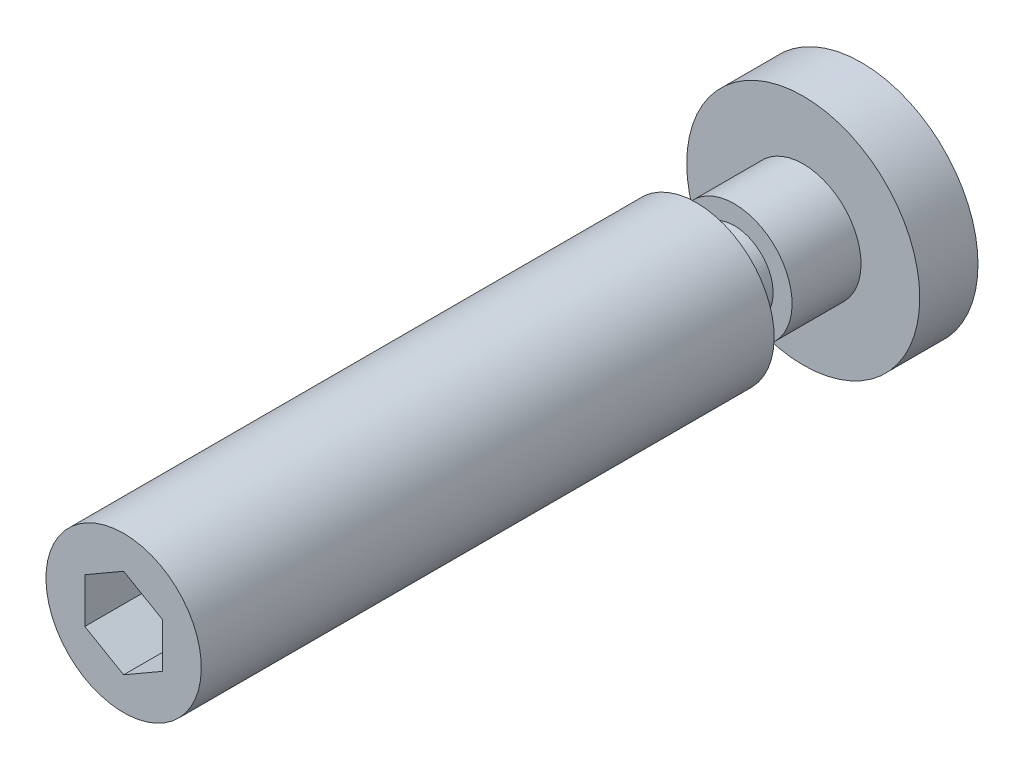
ISO-10303-21;
HEADER;
FILE_DESCRIPTION(('STEP AP214'),'2;1');
FILE_NAME('part.step','',(''),(''),'','','');
FILE_SCHEMA(('AUTOMOTIVE_DESIGN { 1 0 10303 214 1 1 1 1 }'));
ENDSEC;
DATA;
#1=APPLICATION_CONTEXT('core data for automotive mechanical design processes');
#2=APPLICATION_PROTOCOL_DEFINITION('international standard','automotive_design',2000,#1);
#3=PRODUCT_CONTEXT('',#1,'mechanical');
#4=PRODUCT('Part','Part','',(#3));
#5=PRODUCT_RELATED_PRODUCT_CATEGORY('part','',(#4));
#6=PRODUCT_DEFINITION_FORMATION('','',#4);
#7=PRODUCT_DEFINITION_CONTEXT('part definition',#1,'design');
#8=PRODUCT_DEFINITION('design','',#6,#7);
#9=PRODUCT_DEFINITION_SHAPE('','',#8);
#10=(LENGTH_UNIT() NAMED_UNIT(*) SI_UNIT(.MILLI.,.METRE.));
#11=(NAMED_UNIT(*) PLANE_ANGLE_UNIT() SI_UNIT($,.RADIAN.));
#12=(NAMED_UNIT(*) SI_UNIT($,.STERADIAN.) SOLID_ANGLE_UNIT());
#13=UNCERTAINTY_MEASURE_WITH_UNIT(LENGTH_MEASURE(1.E-05),#10,'distance_accuracy_value','');
#14=(GEOMETRIC_REPRESENTATION_CONTEXT(3) GLOBAL_UNCERTAINTY_ASSIGNED_CONTEXT((#13)) GLOBAL_UNIT_ASSIGNED_CONTEXT((#10,
#11,#12)) REPRESENTATION_CONTEXT('',''));
#15=CARTESIAN_POINT('',(0.,0.,0.));
#16=DIRECTION('',(0.,0.,1.));
#17=DIRECTION('',(1.,0.,0.));
#18=AXIS2_PLACEMENT_3D('',#15,#16,#17);
#19=CARTESIAN_POINT('',(0.,0.,0.));
#20=DIRECTION('',(0.,0.,1.));
#21=DIRECTION('',(0.,1.,0.));
#22=AXIS2_PLACEMENT_3D('',#19,#20,#21);
#23=PLANE('',#22);
#24=CARTESIAN_POINT('',(0.,0.,0.));
#25=DIRECTION('',(0.,0.,1.));
#26=DIRECTION('',(0.,1.,0.));
#27=AXIS2_PLACEMENT_3D('',#24,#25,#26);
#28=CIRCLE('',#27,12.);
#29=CARTESIAN_POINT('',(0.,12.,0.));
#30=VERTEX_POINT('',#29);
#31=EDGE_CURVE('E9',#30,#30,#28,.T.);
#32=ORIENTED_EDGE('',*,*,#31,.F.);
#33=EDGE_LOOP('',(#32));
#34=FACE_BOUND('',#33,.T.);
#35=ADVANCED_FACE('F14',(#34),#23,.F.);
#36=CARTESIAN_POINT('',(0.,0.,40.));
#37=DIRECTION('',(0.,0.,1.));
#38=DIRECTION('',(0.,1.,0.));
#39=AXIS2_PLACEMENT_3D('',#36,#37,#38);
#40=CYLINDRICAL_SURFACE('',#39,12.);
#41=CARTESIAN_POINT('',(0.,0.,6.));
#42=DIRECTION('',(0.,0.,1.));
#43=DIRECTION('',(0.,1.,0.));
#44=AXIS2_PLACEMENT_3D('',#41,#42,#43);
#45=CIRCLE('',#44,12.);
#46=CARTESIAN_POINT('',(0.,12.,6.));
#47=VERTEX_POINT('',#46);
#48=EDGE_CURVE('E21',#47,#47,#45,.T.);
#49=ORIENTED_EDGE('',*,*,#48,.F.);
#50=EDGE_LOOP('',(#49));
#51=FACE_BOUND('',#50,.T.);
#52=ORIENTED_EDGE('',*,*,#31,.T.);
#53=EDGE_LOOP('',(#52));
#54=FACE_BOUND('',#53,.T.);
#55=ADVANCED_FACE('F142',(#51,#54),#40,.T.);
#56=CARTESIAN_POINT('',(0.,-12.,6.));
#57=DIRECTION('',(0.,0.,-1.));
#58=DIRECTION('',(0.,-1.,0.));
#59=AXIS2_PLACEMENT_3D('',#56,#57,#58);
#60=PLANE('',#59);
#61=CARTESIAN_POINT('',(0.,0.,6.));
#62=DIRECTION('',(0.,0.,1.));
#63=DIRECTION('',(0.,1.,0.));
#64=AXIS2_PLACEMENT_3D('',#61,#62,#63);
#65=CIRCLE('',#64,5.95);
#66=CARTESIAN_POINT('',(0.,5.95,6.));
#67=VERTEX_POINT('',#66);
#68=EDGE_CURVE('E135',#67,#67,#65,.T.);
#69=ORIENTED_EDGE('',*,*,#68,.F.);
#70=EDGE_LOOP('',(#69));
#71=FACE_BOUND('',#70,.T.);
#72=ORIENTED_EDGE('',*,*,#48,.T.);
#73=EDGE_LOOP('',(#72));
#74=FACE_BOUND('',#73,.T.);
#75=ADVANCED_FACE('F140',(#71,#74),#60,.F.);
#76=CARTESIAN_POINT('',(0.,0.,40.));
#77=DIRECTION('',(0.,0.,1.));
#78=DIRECTION('',(0.,1.,0.));
#79=AXIS2_PLACEMENT_3D('',#76,#77,#78);
#80=CYLINDRICAL_SURFACE('',#79,5.95);
#81=CARTESIAN_POINT('',(0.,0.,13.1));
#82=DIRECTION('',(0.,0.,1.));
#83=DIRECTION('',(0.,1.,0.));
#84=AXIS2_PLACEMENT_3D('',#81,#82,#83);
#85=CIRCLE('',#84,5.95);
#86=CARTESIAN_POINT('',(0.,5.95,13.1));
#87=VERTEX_POINT('',#86);
#88=EDGE_CURVE('E132',#87,#87,#85,.T.);
#89=ORIENTED_EDGE('',*,*,#88,.F.);
#90=EDGE_LOOP('',(#89));
#91=FACE_BOUND('',#90,.T.);
#92=ORIENTED_EDGE('',*,*,#68,.T.);
#93=EDGE_LOOP('',(#92));
#94=FACE_BOUND('',#93,.T.);
#95=ADVANCED_FACE('F165',(#91,#94),#80,.T.);
#96=CARTESIAN_POINT('',(0.,-5.95,13.1));
#97=DIRECTION('',(0.,0.,-1.));
#98=DIRECTION('',(0.,-1.,0.));
#99=AXIS2_PLACEMENT_3D('',#96,#97,#98);
#100=PLANE('',#99);
#101=CARTESIAN_POINT('',(0.,0.,13.1));
#102=DIRECTION('',(0.,0.,1.));
#103=DIRECTION('',(0.,1.,0.));
#104=AXIS2_PLACEMENT_3D('',#101,#102,#103);
#105=CIRCLE('',#104,4.);
#106=CARTESIAN_POINT('',(0.,4.,13.1));
#107=VERTEX_POINT('',#106);
#108=EDGE_CURVE('E129',#107,#107,#105,.T.);
#109=ORIENTED_EDGE('',*,*,#108,.F.);
#110=EDGE_LOOP('',(#109));
#111=FACE_BOUND('',#110,.T.);
#112=ORIENTED_EDGE('',*,*,#88,.T.);
#113=EDGE_LOOP('',(#112));
#114=FACE_BOUND('',#113,.T.);
#115=ADVANCED_FACE('F174',(#111,#114),#100,.F.);
#116=CARTESIAN_POINT('',(0.,0.,40.));
#117=DIRECTION('',(0.,0.,1.));
#118=DIRECTION('',(0.,1.,0.));
#119=AXIS2_PLACEMENT_3D('',#116,#117,#118);
#120=CYLINDRICAL_SURFACE('',#119,4.);
#121=CARTESIAN_POINT('',(0.,0.,17.));
#122=DIRECTION('',(0.,0.,1.));
#123=DIRECTION('',(0.,1.,0.));
#124=AXIS2_PLACEMENT_3D('',#121,#122,#123);
#125=CIRCLE('',#124,4.);
#126=CARTESIAN_POINT('',(0.,4.,17.));
#127=VERTEX_POINT('',#126);
#128=EDGE_CURVE('E126',#127,#127,#125,.T.);
#129=ORIENTED_EDGE('',*,*,#128,.F.);
#130=EDGE_LOOP('',(#129));
#131=FACE_BOUND('',#130,.T.);
#132=ORIENTED_EDGE('',*,*,#108,.T.);
#133=EDGE_LOOP('',(#132));
#134=FACE_BOUND('',#133,.T.);
#135=ADVANCED_FACE('F183',(#131,#134),#120,.T.);
#136=CARTESIAN_POINT('',(0.,-4.,17.));
#137=DIRECTION('',(0.,0.,1.));
#138=DIRECTION('',(0.,1.,0.));
#139=AXIS2_PLACEMENT_3D('',#136,#137,#138);
#140=PLANE('',#139);
#141=CARTESIAN_POINT('',(0.,0.,17.));
#142=DIRECTION('',(0.,0.,1.));
#143=DIRECTION('',(0.,1.,0.));
#144=AXIS2_PLACEMENT_3D('',#141,#142,#143);
#145=CIRCLE('',#144,8.);
#146=CARTESIAN_POINT('',(0.,8.,17.));
#147=VERTEX_POINT('',#146);
#148=EDGE_CURVE('E123',#147,#147,#145,.T.);
#149=ORIENTED_EDGE('',*,*,#148,.F.);
#150=EDGE_LOOP('',(#149));
#151=FACE_BOUND('',#150,.T.);
#152=ORIENTED_EDGE('',*,*,#128,.T.);
#153=EDGE_LOOP('',(#152));
#154=FACE_BOUND('',#153,.T.);
#155=ADVANCED_FACE('F192',(#151,#154),#140,.F.);
#156=CARTESIAN_POINT('',(0.,0.,40.));
#157=DIRECTION('',(0.,0.,1.));
#158=DIRECTION('',(0.,1.,0.));
#159=AXIS2_PLACEMENT_3D('',#156,#157,#158);
#160=CYLINDRICAL_SURFACE('',#159,8.);
#161=CARTESIAN_POINT('',(0.,0.,76.));
#162=DIRECTION('',(0.,0.,1.));
#163=DIRECTION('',(0.,1.,0.));
#164=AXIS2_PLACEMENT_3D('',#161,#162,#163);
#165=CIRCLE('',#164,8.);
#166=CARTESIAN_POINT('',(0.,8.,76.));
#167=VERTEX_POINT('',#166);
#168=EDGE_CURVE('E115',#167,#167,#165,.T.);
#169=ORIENTED_EDGE('',*,*,#168,.F.);
#170=EDGE_LOOP('',(#169));
#171=FACE_BOUND('',#170,.T.);
#172=ORIENTED_EDGE('',*,*,#148,.T.);
#173=EDGE_LOOP('',(#172));
#174=FACE_BOUND('',#173,.T.);
#175=ADVANCED_FACE('F201',(#171,#174),#160,.T.);
#176=CARTESIAN_POINT('',(0.,-8.,76.));
#177=DIRECTION('',(0.,0.,-1.));
#178=DIRECTION('',(0.,-1.,0.));
#179=AXIS2_PLACEMENT_3D('',#176,#177,#178);
#180=PLANE('',#179);
#181=DIRECTION('',(-0.866025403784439,-0.5,0.));
#182=VECTOR('',#181,1.);
#183=CARTESIAN_POINT('',(0.,4.61880215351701,76.));
#184=LINE('',#183,#182);
#185=CARTESIAN_POINT('',(0.,4.61880215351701,76.));
#186=VERTEX_POINT('',#185);
#187=CARTESIAN_POINT('',(-4.,2.30940107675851,76.));
#188=VERTEX_POINT('',#187);
#189=EDGE_CURVE('E102',#186,#188,#184,.T.);
#190=ORIENTED_EDGE('',*,*,#189,.F.);
#191=DIRECTION('',(-0.866025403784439,0.5,0.));
#192=VECTOR('',#191,1.);
#193=CARTESIAN_POINT('',(4.,2.30940107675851,76.));
#194=LINE('',#193,#192);
#195=CARTESIAN_POINT('',(4.,2.30940107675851,76.));
#196=VERTEX_POINT('',#195);
#197=EDGE_CURVE('E28',#196,#186,#194,.T.);
#198=ORIENTED_EDGE('',*,*,#197,.F.);
#199=DIRECTION('',(0.,1.,0.));
#200=VECTOR('',#199,1.);
#201=CARTESIAN_POINT('',(4.,-2.30940107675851,76.));
#202=LINE('',#201,#200);
#203=CARTESIAN_POINT('',(4.,-2.30940107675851,76.));
#204=VERTEX_POINT('',#203);
#205=EDGE_CURVE('E111',#204,#196,#202,.T.);
#206=ORIENTED_EDGE('',*,*,#205,.F.);
#207=DIRECTION('',(0.866025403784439,0.5,0.));
#208=VECTOR('',#207,1.);
#209=CARTESIAN_POINT('',(0.,-4.61880215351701,76.));
#210=LINE('',#209,#208);
#211=CARTESIAN_POINT('',(0.,-4.61880215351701,76.));
#212=VERTEX_POINT('',#211);
#213=EDGE_CURVE('E109',#212,#204,#210,.T.);
#214=ORIENTED_EDGE('',*,*,#213,.F.);
#215=DIRECTION('',(0.866025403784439,-0.5,0.));
#216=VECTOR('',#215,1.);
#217=CARTESIAN_POINT('',(-4.,-2.30940107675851,76.));
#218=LINE('',#217,#216);
#219=CARTESIAN_POINT('',(-4.,-2.30940107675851,76.));
#220=VERTEX_POINT('',#219);
#221=EDGE_CURVE('E76',#220,#212,#218,.T.);
#222=ORIENTED_EDGE('',*,*,#221,.F.);
#223=DIRECTION('',(0.,-1.,0.));
#224=VECTOR('',#223,1.);
#225=CARTESIAN_POINT('',(-4.,2.30940107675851,76.));
#226=LINE('',#225,#224);
#227=EDGE_CURVE('E105',#188,#220,#226,.T.);
#228=ORIENTED_EDGE('',*,*,#227,.F.);
#229=EDGE_LOOP('',(#190,#198,#206,#214,#222,#228));
#230=FACE_BOUND('',#229,.T.);
#231=ORIENTED_EDGE('',*,*,#168,.T.);
#232=EDGE_LOOP('',(#231));
#233=FACE_BOUND('',#232,.T.);
#234=ADVANCED_FACE('F210',(#230,#233),#180,.F.);
#235=CARTESIAN_POINT('',(4.,2.30940107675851,66.));
#236=DIRECTION('',(0.5,0.866025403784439,0.));
#237=DIRECTION('',(-0.866025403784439,0.5,0.));
#238=AXIS2_PLACEMENT_3D('',#235,#236,#237);
#239=PLANE('',#238);
#240=ORIENTED_EDGE('',*,*,#197,.T.);
#241=DIRECTION('',(0.,0.,1.));
#242=VECTOR('',#241,1.);
#243=CARTESIAN_POINT('',(0.,4.61880215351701,66.));
#244=LINE('',#243,#242);
#245=CARTESIAN_POINT('',(0.,4.61880215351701,66.));
#246=VERTEX_POINT('',#245);
#247=EDGE_CURVE('E58',#246,#186,#244,.T.);
#248=ORIENTED_EDGE('',*,*,#247,.F.);
#249=DIRECTION('',(-0.866025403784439,0.5,0.));
#250=VECTOR('',#249,1.);
#251=CARTESIAN_POINT('',(4.,2.30940107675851,66.));
#252=LINE('',#251,#250);
#253=CARTESIAN_POINT('',(4.,2.30940107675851,66.));
#254=VERTEX_POINT('',#253);
#255=EDGE_CURVE('E113',#254,#246,#252,.T.);
#256=ORIENTED_EDGE('',*,*,#255,.F.);
#257=DIRECTION('',(0.,0.,1.));
#258=VECTOR('',#257,1.);
#259=CARTESIAN_POINT('',(4.,2.30940107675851,66.));
#260=LINE('',#259,#258);
#261=EDGE_CURVE('E36',#254,#196,#260,.T.);
#262=ORIENTED_EDGE('',*,*,#261,.T.);
#263=EDGE_LOOP('',(#240,#248,#256,#262));
#264=FACE_BOUND('',#263,.T.);
#265=ADVANCED_FACE('F219',(#264),#239,.F.);
#266=CARTESIAN_POINT('',(4.,-2.30940107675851,66.));
#267=DIRECTION('',(1.,0.,0.));
#268=DIRECTION('',(0.,0.,-1.));
#269=AXIS2_PLACEMENT_3D('',#266,#267,#268);
#270=PLANE('',#269);
#271=ORIENTED_EDGE('',*,*,#205,.T.);
#272=ORIENTED_EDGE('',*,*,#261,.F.);
#273=DIRECTION('',(0.,1.,0.));
#274=VECTOR('',#273,1.);
#275=CARTESIAN_POINT('',(4.,-2.30940107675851,66.));
#276=LINE('',#275,#274);
#277=CARTESIAN_POINT('',(4.,-2.30940107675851,66.));
#278=VERTEX_POINT('',#277);
#279=EDGE_CURVE('E88',#278,#254,#276,.T.);
#280=ORIENTED_EDGE('',*,*,#279,.F.);
#281=DIRECTION('',(0.,0.,1.));
#282=VECTOR('',#281,1.);
#283=CARTESIAN_POINT('',(4.,-2.30940107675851,66.));
#284=LINE('',#283,#282);
#285=EDGE_CURVE('E80',#278,#204,#284,.T.);
#286=ORIENTED_EDGE('',*,*,#285,.T.);
#287=EDGE_LOOP('',(#271,#272,#280,#286));
#288=FACE_BOUND('',#287,.T.);
#289=ADVANCED_FACE('F228',(#288),#270,.F.);
#290=CARTESIAN_POINT('',(0.,-4.61880215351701,66.));
#291=DIRECTION('',(0.5,-0.866025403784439,0.));
#292=DIRECTION('',(0.866025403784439,0.5,0.));
#293=AXIS2_PLACEMENT_3D('',#290,#291,#292);
#294=PLANE('',#293);
#295=ORIENTED_EDGE('',*,*,#213,.T.);
#296=ORIENTED_EDGE('',*,*,#285,.F.);
#297=DIRECTION('',(0.866025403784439,0.5,0.));
#298=VECTOR('',#297,1.);
#299=CARTESIAN_POINT('',(0.,-4.61880215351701,66.));
#300=LINE('',#299,#298);
#301=CARTESIAN_POINT('',(0.,-4.61880215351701,66.));
#302=VERTEX_POINT('',#301);
#303=EDGE_CURVE('E84',#302,#278,#300,.T.);
#304=ORIENTED_EDGE('',*,*,#303,.F.);
#305=DIRECTION('',(0.,0.,1.));
#306=VECTOR('',#305,1.);
#307=CARTESIAN_POINT('',(0.,-4.61880215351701,66.));
#308=LINE('',#307,#306);
#309=EDGE_CURVE('E69',#302,#212,#308,.T.);
#310=ORIENTED_EDGE('',*,*,#309,.T.);
#311=EDGE_LOOP('',(#295,#296,#304,#310));
#312=FACE_BOUND('',#311,.T.);
#313=ADVANCED_FACE('F85',(#312),#294,.F.);
#314=CARTESIAN_POINT('',(-4.,-2.30940107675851,66.));
#315=DIRECTION('',(-0.5,-0.866025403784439,0.));
#316=DIRECTION('',(0.866025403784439,-0.5,0.));
#317=AXIS2_PLACEMENT_3D('',#314,#315,#316);
#318=PLANE('',#317);
#319=ORIENTED_EDGE('',*,*,#221,.T.);
#320=ORIENTED_EDGE('',*,*,#309,.F.);
#321=DIRECTION('',(0.866025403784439,-0.5,0.));
#322=VECTOR('',#321,1.);
#323=CARTESIAN_POINT('',(-4.,-2.30940107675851,66.));
#324=LINE('',#323,#322);
#325=CARTESIAN_POINT('',(-4.,-2.30940107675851,66.));
#326=VERTEX_POINT('',#325);
#327=EDGE_CURVE('E73',#326,#302,#324,.T.);
#328=ORIENTED_EDGE('',*,*,#327,.F.);
#329=DIRECTION('',(0.,0.,1.));
#330=VECTOR('',#329,1.);
#331=CARTESIAN_POINT('',(-4.,-2.30940107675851,66.));
#332=LINE('',#331,#330);
#333=EDGE_CURVE('E81',#326,#220,#332,.T.);
#334=ORIENTED_EDGE('',*,*,#333,.T.);
#335=EDGE_LOOP('',(#319,#320,#328,#334));
#336=FACE_BOUND('',#335,.T.);
#337=ADVANCED_FACE('F71',(#336),#318,.F.);
#338=CARTESIAN_POINT('',(-4.,2.30940107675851,66.));
#339=DIRECTION('',(-1.,0.,0.));
#340=DIRECTION('',(0.,-1.,0.));
#341=AXIS2_PLACEMENT_3D('',#338,#339,#340);
#342=PLANE('',#341);
#343=ORIENTED_EDGE('',*,*,#227,.T.);
#344=ORIENTED_EDGE('',*,*,#333,.F.);
#345=DIRECTION('',(0.,-1.,0.));
#346=VECTOR('',#345,1.);
#347=CARTESIAN_POINT('',(-4.,2.30940107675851,66.));
#348=LINE('',#347,#346);
#349=CARTESIAN_POINT('',(-4.,2.30940107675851,66.));
#350=VERTEX_POINT('',#349);
#351=EDGE_CURVE('E94',#350,#326,#348,.T.);
#352=ORIENTED_EDGE('',*,*,#351,.F.);
#353=DIRECTION('',(0.,0.,1.));
#354=VECTOR('',#353,1.);
#355=CARTESIAN_POINT('',(-4.,2.30940107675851,66.));
#356=LINE('',#355,#354);
#357=EDGE_CURVE('E118',#350,#188,#356,.T.);
#358=ORIENTED_EDGE('',*,*,#357,.T.);
#359=EDGE_LOOP('',(#343,#344,#352,#358));
#360=FACE_BOUND('',#359,.T.);
#361=ADVANCED_FACE('F250',(#360),#342,.F.);
#362=CARTESIAN_POINT('',(0.,4.61880215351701,66.));
#363=DIRECTION('',(-0.5,0.866025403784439,0.));
#364=DIRECTION('',(-0.866025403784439,-0.5,0.));
#365=AXIS2_PLACEMENT_3D('',#362,#363,#364);
#366=PLANE('',#365);
#367=ORIENTED_EDGE('',*,*,#189,.T.);
#368=ORIENTED_EDGE('',*,*,#357,.F.);
#369=DIRECTION('',(-0.866025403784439,-0.5,0.));
#370=VECTOR('',#369,1.);
#371=CARTESIAN_POINT('',(0.,4.61880215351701,66.));
#372=LINE('',#371,#370);
#373=EDGE_CURVE('E96',#246,#350,#372,.T.);
#374=ORIENTED_EDGE('',*,*,#373,.F.);
#375=ORIENTED_EDGE('',*,*,#247,.T.);
#376=EDGE_LOOP('',(#367,#368,#374,#375));
#377=FACE_BOUND('',#376,.T.);
#378=ADVANCED_FACE('F258',(#377),#366,.F.);
#379=CARTESIAN_POINT('',(0.,4.61880215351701,66.));
#380=DIRECTION('',(0.,0.,1.));
#381=DIRECTION('',(1.,0.,0.));
#382=AXIS2_PLACEMENT_3D('',#379,#380,#381);
#383=PLANE('',#382);
#384=ORIENTED_EDGE('',*,*,#255,.T.);
#385=ORIENTED_EDGE('',*,*,#373,.T.);
#386=ORIENTED_EDGE('',*,*,#351,.T.);
#387=ORIENTED_EDGE('',*,*,#327,.T.);
#388=ORIENTED_EDGE('',*,*,#303,.T.);
#389=ORIENTED_EDGE('',*,*,#279,.T.);
#390=EDGE_LOOP('',(#384,#385,#386,#387,#388,#389));
#391=FACE_BOUND('',#390,.T.);
#392=ADVANCED_FACE('F91',(#391),#383,.T.);
#393=CLOSED_SHELL('',(#35,#55,#75,#95,#115,#135,#155,#175,#234,#265,#289,#313,#337,#361,#378,#392));
#394=MANIFOLD_SOLID_BREP('B1',#393);
#395=ADVANCED_BREP_SHAPE_REPRESENTATION('',(#18,#394),#14);
#396=SHAPE_DEFINITION_REPRESENTATION(#9,#395);
ENDSEC;
END-ISO-10303-21;
